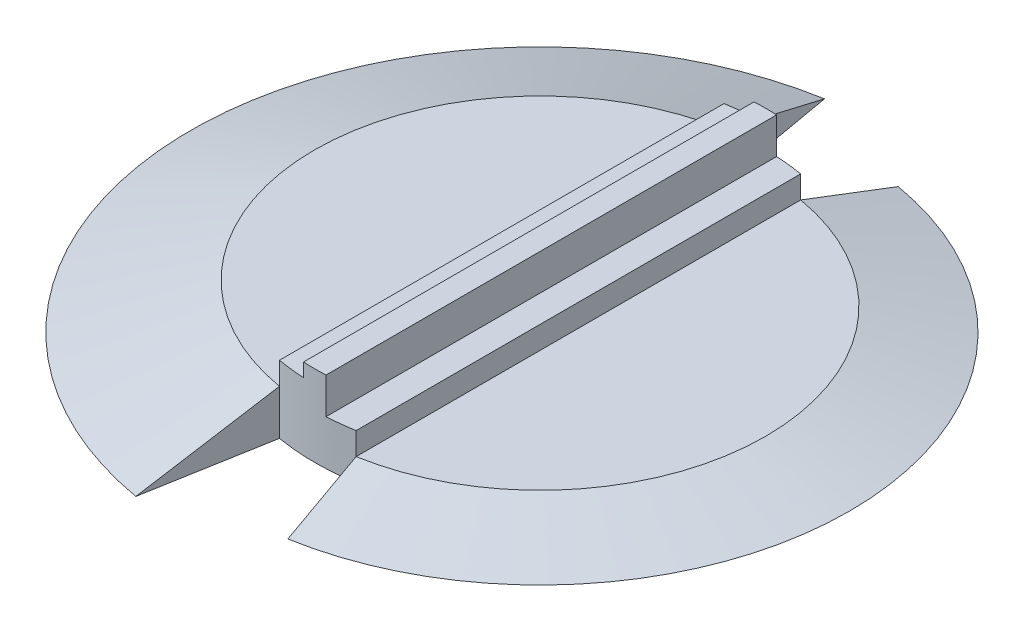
from build123d import *

# Parameters (mm, degrees)
CUT_EXTRUDE_1_DEPTH = 2201.425529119
CUT_EXTRUDE_2_DEPTH = 2185.359196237
EXTRUDE_4_DEPTH     = 100
EXTRUDE_5_DEPTH     = 100
EXTRUDE_6_DEPTH     = 160


with BuildPart() as part:
    # Sketch 1 → Revolve 1 (revolve)
    with BuildSketch(Plane.XY, mode=Mode.PRIVATE) as revolve_1_sk:
        Polygon((0, 0), (-1549.495483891, 0), (-1000, 200), (0, 200), align=None)
    revolve(revolve_1_sk.sketch.rotate(Axis((0, 649.238191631, 0), (0, -1, 0)), 270), axis=Axis((0, 649.238191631, 0), (0, -1, 0)))

    # Sketch 4 → Cut-Extrude 1 (cut, through all)
    with BuildSketch(Plane(origin=(0, 0, 0), x_dir=(1, 0, 0), z_dir=(0, 1, 0))):
        with BuildLine():
            Line((-265.419311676, 1526.593869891), (-170, 985.444062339))
            ThreePointArc((-170, 985.444062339), (0, 1000), (170, 985.444062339))
            Line((170, 985.444062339), (170, -985.444062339))
            ThreePointArc((170, -985.444062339), (0, -1000), (-170, -985.444062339))
            Line((-170, -985.444062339), (-265.419311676, -1526.593869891))
            ThreePointArc((-265.419311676, -1526.593869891), (1549.495483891, 0), (-265.419311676, 1526.593869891))
        make_face()
    extrude(amount=CUT_EXTRUDE_1_DEPTH, mode=Mode.SUBTRACT)

    # Sketch 5 → Revolve 2 (revolve)
    with BuildSketch(Plane.XY):
        Polygon((0, 0), (0, 100), (1000, 100), (1373.205080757, 0), align=None)
    revolve(axis=Axis((0, 0, 0), (0, 1, 0)))

    # Sketch 6 → Cut-Extrude 2 (cut, through all)
    with BuildSketch(Plane(origin=(0, 0, 0), x_dir=(1, 0, 0), z_dir=(0, 1, 0))):
        with BuildLine():
            Line((170, 985.444062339), (234.806705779, 1352.981154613))
            ThreePointArc((234.806705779, 1352.981154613), (0, 1373.205080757), (-234.806705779, 1352.981154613))
            Line((-234.806705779, 1352.981154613), (-170, 985.444062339))
            ThreePointArc((-170, 985.444062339), (0, 1000), (170, 985.444062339))
        make_face()
        with BuildLine():
            Line((234.806705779, -1352.981154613), (170, -985.444062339))
            ThreePointArc((170, -985.444062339), (0, -1000), (-170, -985.444062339))
            Line((-170, -985.444062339), (-234.806705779, -1352.981154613))
            ThreePointArc((-234.806705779, -1352.981154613), (0, -1373.205080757), (234.806705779, -1352.981154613))
        make_face()
    extrude(amount=CUT_EXTRUDE_2_DEPTH, mode=Mode.SUBTRACT)

    # Sketch 7 → Extrude 4 (add)
    with BuildSketch(Plane(origin=(0, 200, 0), x_dir=(1, 0, 0), z_dir=(0, 1, 0))):
        with BuildLine():
            ThreePointArc((-50, 998.749217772), (-110.200983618, 993.909323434), (-170, 985.444062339))
            Line((-170, 985.444062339), (-170, -985.444062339))
            ThreePointArc((-170, -985.444062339), (-110.200983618, -993.909323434), (-50, -998.749217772))
            Line((-50, -998.749217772), (-50, 998.749217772))
        make_face()
    extrude(amount=EXTRUDE_4_DEPTH)

    # Sketch 7_3 → Extrude 5 (add)
    with BuildSketch(Plane(origin=(0, 200, 0), x_dir=(1, 0, 0), z_dir=(0, 1, 0))):
        with BuildLine():
            ThreePointArc((-50, 998.749217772), (-110.200983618, 993.909323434), (-170, 985.444062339))
            Line((-170, 985.444062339), (-170, -985.444062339))
            ThreePointArc((-170, -985.444062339), (-110.200983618, -993.909323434), (-50, -998.749217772))
            Line((-50, -998.749217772), (-50, 998.749217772))
        make_face()
    extrude(amount=EXTRUDE_5_DEPTH)

    # Sketch 7_4 → Extrude 6 (add)
    with BuildSketch(Plane(origin=(0, 200, 0), x_dir=(1, 0, 0), z_dir=(0, 1, 0))):
        with BuildLine():
            ThreePointArc((50, 998.749217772), (25.007821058, 999.687255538), (0, 1000))
            Line((0, 1000), (0, -1000))
            ThreePointArc((0, -1000), (25.007821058, -999.687255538), (50, -998.749217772))
            Line((50, -998.749217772), (50, 998.749217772))
        make_face()
        with BuildLine():
            ThreePointArc((0, 1000), (-25.007821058, 999.687255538), (-50, 998.749217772))
            Line((-50, 998.749217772), (-50, -998.749217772))
            ThreePointArc((-50, -998.749217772), (-25.007821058, -999.687255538), (0, -1000))
            Line((0, -1000), (0, 1000))
        make_face()
    extrude(amount=EXTRUDE_6_DEPTH)


solid = part.part
